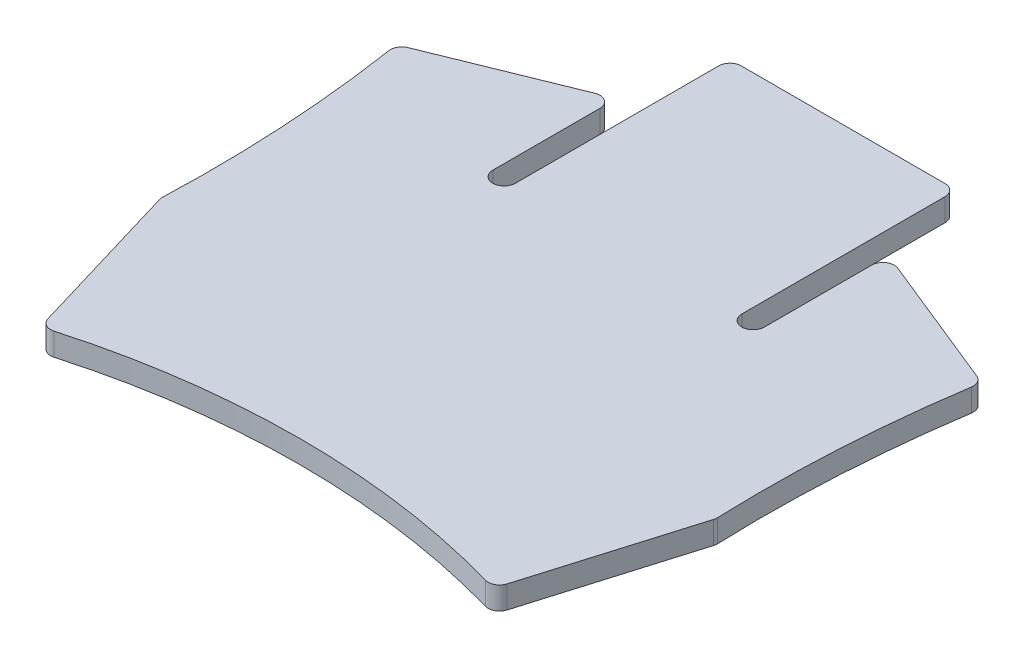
ISO-10303-21;
HEADER;
FILE_DESCRIPTION(('STEP AP214'),'2;1');
FILE_NAME('part.step','',(''),(''),'','','');
FILE_SCHEMA(('AUTOMOTIVE_DESIGN { 1 0 10303 214 1 1 1 1 }'));
ENDSEC;
DATA;
#1=APPLICATION_CONTEXT('core data for automotive mechanical design processes');
#2=APPLICATION_PROTOCOL_DEFINITION('international standard','automotive_design',2000,#1);
#3=PRODUCT_CONTEXT('',#1,'mechanical');
#4=PRODUCT('Part','Part','',(#3));
#5=PRODUCT_RELATED_PRODUCT_CATEGORY('part','',(#4));
#6=PRODUCT_DEFINITION_FORMATION('','',#4);
#7=PRODUCT_DEFINITION_CONTEXT('part definition',#1,'design');
#8=PRODUCT_DEFINITION('design','',#6,#7);
#9=PRODUCT_DEFINITION_SHAPE('','',#8);
#10=(LENGTH_UNIT() NAMED_UNIT(*) SI_UNIT(.MILLI.,.METRE.));
#11=(NAMED_UNIT(*) PLANE_ANGLE_UNIT() SI_UNIT($,.RADIAN.));
#12=(NAMED_UNIT(*) SI_UNIT($,.STERADIAN.) SOLID_ANGLE_UNIT());
#13=UNCERTAINTY_MEASURE_WITH_UNIT(LENGTH_MEASURE(1.E-05),#10,'distance_accuracy_value','');
#14=(GEOMETRIC_REPRESENTATION_CONTEXT(3) GLOBAL_UNCERTAINTY_ASSIGNED_CONTEXT((#13)) GLOBAL_UNIT_ASSIGNED_CONTEXT((#10,
#11,#12)) REPRESENTATION_CONTEXT('',''));
#15=CARTESIAN_POINT('',(0.,0.,0.));
#16=DIRECTION('',(0.,0.,1.));
#17=DIRECTION('',(1.,0.,0.));
#18=AXIS2_PLACEMENT_3D('',#15,#16,#17);
#19=CARTESIAN_POINT('',(-11.,2.,-2.49352029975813));
#20=DIRECTION('',(0.,-1.,0.));
#21=DIRECTION('',(0.,0.,-1.));
#22=AXIS2_PLACEMENT_3D('',#19,#20,#21);
#23=CYLINDRICAL_SURFACE('',#22,0.999999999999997);
#24=CARTESIAN_POINT('',(-11.,0.,-2.49352029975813));
#25=DIRECTION('',(0.,-1.,0.));
#26=DIRECTION('',(0.,0.,-1.));
#27=AXIS2_PLACEMENT_3D('',#24,#25,#26);
#28=CIRCLE('',#27,0.999999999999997);
#29=CARTESIAN_POINT('',(-10.,0.,-2.49352029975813));
#30=VERTEX_POINT('',#29);
#31=CARTESIAN_POINT('',(-12.,0.,-2.49352029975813));
#32=VERTEX_POINT('',#31);
#33=EDGE_CURVE('E224',#30,#32,#28,.T.);
#34=ORIENTED_EDGE('',*,*,#33,.T.);
#35=DIRECTION('',(0.,-1.,0.));
#36=VECTOR('',#35,1.);
#37=CARTESIAN_POINT('',(-12.,2.,-2.49352029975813));
#38=LINE('',#37,#36);
#39=CARTESIAN_POINT('',(-12.,2.,-2.49352029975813));
#40=VERTEX_POINT('',#39);
#41=EDGE_CURVE('E11',#40,#32,#38,.T.);
#42=ORIENTED_EDGE('',*,*,#41,.F.);
#43=CARTESIAN_POINT('',(-11.,2.,-2.49352029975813));
#44=DIRECTION('',(0.,-1.,0.));
#45=DIRECTION('',(0.,0.,-1.));
#46=AXIS2_PLACEMENT_3D('',#43,#44,#45);
#47=CIRCLE('',#46,0.999999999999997);
#48=CARTESIAN_POINT('',(-10.,2.,-2.49352029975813));
#49=VERTEX_POINT('',#48);
#50=EDGE_CURVE('E271',#49,#40,#47,.T.);
#51=ORIENTED_EDGE('',*,*,#50,.F.);
#52=DIRECTION('',(0.,-1.,0.));
#53=VECTOR('',#52,1.);
#54=CARTESIAN_POINT('',(-10.,2.,-2.49352029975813));
#55=LINE('',#54,#53);
#56=EDGE_CURVE('E220',#49,#30,#55,.T.);
#57=ORIENTED_EDGE('',*,*,#56,.T.);
#58=EDGE_LOOP('',(#34,#42,#51,#57));
#59=FACE_BOUND('',#58,.T.);
#60=ADVANCED_FACE('F32',(#59),#23,.F.);
#61=CARTESIAN_POINT('',(-12.,2.,-2.49352029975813));
#62=DIRECTION('',(-1.,0.,0.));
#63=DIRECTION('',(0.,0.,1.));
#64=AXIS2_PLACEMENT_3D('',#61,#62,#63);
#65=PLANE('',#64);
#66=DIRECTION('',(0.,0.,-1.));
#67=VECTOR('',#66,1.);
#68=CARTESIAN_POINT('',(-12.,0.,-2.49352029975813));
#69=LINE('',#68,#67);
#70=CARTESIAN_POINT('',(-12.,0.,-11.9635562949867));
#71=VERTEX_POINT('',#70);
#72=EDGE_CURVE('E227',#32,#71,#69,.T.);
#73=ORIENTED_EDGE('',*,*,#72,.T.);
#74=DIRECTION('',(0.,-1.,0.));
#75=VECTOR('',#74,1.);
#76=CARTESIAN_POINT('',(-12.,2.,-11.9635562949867));
#77=LINE('',#76,#75);
#78=CARTESIAN_POINT('',(-12.,2.,-11.9635562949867));
#79=VERTEX_POINT('',#78);
#80=EDGE_CURVE('E40',#79,#71,#77,.T.);
#81=ORIENTED_EDGE('',*,*,#80,.F.);
#82=DIRECTION('',(0.,0.,-1.));
#83=VECTOR('',#82,1.);
#84=CARTESIAN_POINT('',(-12.,2.,-2.49352029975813));
#85=LINE('',#84,#83);
#86=EDGE_CURVE('E139',#40,#79,#85,.T.);
#87=ORIENTED_EDGE('',*,*,#86,.F.);
#88=ORIENTED_EDGE('',*,*,#41,.T.);
#89=EDGE_LOOP('',(#73,#81,#87,#88));
#90=FACE_BOUND('',#89,.T.);
#91=ADVANCED_FACE('F409',(#90),#65,.F.);
#92=CARTESIAN_POINT('',(-13.,2.,-11.9635562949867));
#93=DIRECTION('',(0.,-1.,0.));
#94=DIRECTION('',(0.,0.,-1.));
#95=AXIS2_PLACEMENT_3D('',#92,#93,#94);
#96=CYLINDRICAL_SURFACE('',#95,1.);
#97=CARTESIAN_POINT('',(-13.,0.,-11.9635562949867));
#98=DIRECTION('',(0.,1.,0.));
#99=DIRECTION('',(0.,0.,1.));
#100=AXIS2_PLACEMENT_3D('',#97,#98,#99);
#101=CIRCLE('',#100,1.);
#102=CARTESIAN_POINT('',(-13.3756805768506,0.,-12.8903055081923));
#103=VERTEX_POINT('',#102);
#104=EDGE_CURVE('E229',#71,#103,#101,.T.);
#105=ORIENTED_EDGE('',*,*,#104,.T.);
#106=DIRECTION('',(0.,-1.,0.));
#107=VECTOR('',#106,1.);
#108=CARTESIAN_POINT('',(-13.3756805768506,2.,-12.8903055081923));
#109=LINE('',#108,#107);
#110=CARTESIAN_POINT('',(-13.3756805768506,2.,-12.8903055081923));
#111=VERTEX_POINT('',#110);
#112=EDGE_CURVE('E326',#111,#103,#109,.T.);
#113=ORIENTED_EDGE('',*,*,#112,.F.);
#114=CARTESIAN_POINT('',(-13.,2.,-11.9635562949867));
#115=DIRECTION('',(0.,1.,0.));
#116=DIRECTION('',(0.,0.,1.));
#117=AXIS2_PLACEMENT_3D('',#114,#115,#116);
#118=CIRCLE('',#117,1.);
#119=EDGE_CURVE('E334',#79,#111,#118,.T.);
#120=ORIENTED_EDGE('',*,*,#119,.F.);
#121=ORIENTED_EDGE('',*,*,#80,.T.);
#122=EDGE_LOOP('',(#105,#113,#120,#121));
#123=FACE_BOUND('',#122,.T.);
#124=ADVANCED_FACE('F332',(#123),#96,.T.);
#125=CARTESIAN_POINT('',(-13.3756805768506,2.,-12.8903055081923));
#126=DIRECTION('',(0.375680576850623,0.,0.926749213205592));
#127=DIRECTION('',(0.926749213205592,0.,-0.375680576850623));
#128=AXIS2_PLACEMENT_3D('',#125,#126,#127);
#129=PLANE('',#128);
#130=DIRECTION('',(-0.926749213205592,0.,0.375680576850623));
#131=VECTOR('',#130,1.);
#132=CARTESIAN_POINT('',(-13.3756805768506,0.,-12.8903055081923));
#133=LINE('',#132,#131);
#134=CARTESIAN_POINT('',(-25.1183486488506,0.,-8.13012632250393));
#135=VERTEX_POINT('',#134);
#136=EDGE_CURVE('E231',#103,#135,#133,.T.);
#137=ORIENTED_EDGE('',*,*,#136,.T.);
#138=DIRECTION('',(0.,-1.,0.));
#139=VECTOR('',#138,1.);
#140=CARTESIAN_POINT('',(-25.1183486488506,2.,-8.13012632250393));
#141=LINE('',#140,#139);
#142=CARTESIAN_POINT('',(-25.1183486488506,2.,-8.13012632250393));
#143=VERTEX_POINT('',#142);
#144=EDGE_CURVE('E323',#143,#135,#141,.T.);
#145=ORIENTED_EDGE('',*,*,#144,.F.);
#146=DIRECTION('',(-0.926749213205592,0.,0.375680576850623));
#147=VECTOR('',#146,1.);
#148=CARTESIAN_POINT('',(-13.3756805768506,2.,-12.8903055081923));
#149=LINE('',#148,#147);
#150=EDGE_CURVE('E352',#111,#143,#149,.T.);
#151=ORIENTED_EDGE('',*,*,#150,.F.);
#152=ORIENTED_EDGE('',*,*,#112,.T.);
#153=EDGE_LOOP('',(#137,#145,#151,#152));
#154=FACE_BOUND('',#153,.T.);
#155=ADVANCED_FACE('F343',(#154),#129,.F.);
#156=CARTESIAN_POINT('',(-24.7426680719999,2.,-7.20337710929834));
#157=DIRECTION('',(0.,-1.,0.));
#158=DIRECTION('',(0.,0.,-1.));
#159=AXIS2_PLACEMENT_3D('',#156,#157,#158);
#160=CYLINDRICAL_SURFACE('',#159,0.999999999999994);
#161=CARTESIAN_POINT('',(-24.7426680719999,0.,-7.20337710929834));
#162=DIRECTION('',(0.,1.,0.));
#163=DIRECTION('',(0.,0.,1.));
#164=AXIS2_PLACEMENT_3D('',#161,#162,#163);
#165=CIRCLE('',#164,0.999999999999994);
#166=CARTESIAN_POINT('',(-25.7312131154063,0.,-7.05245097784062));
#167=VERTEX_POINT('',#166);
#168=EDGE_CURVE('E233',#135,#167,#165,.T.);
#169=ORIENTED_EDGE('',*,*,#168,.T.);
#170=DIRECTION('',(0.,-1.,0.));
#171=VECTOR('',#170,1.);
#172=CARTESIAN_POINT('',(-25.7312131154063,2.,-7.05245097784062));
#173=LINE('',#172,#171);
#174=CARTESIAN_POINT('',(-25.7312131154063,2.,-7.05245097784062));
#175=VERTEX_POINT('',#174);
#176=EDGE_CURVE('E320',#175,#167,#173,.T.);
#177=ORIENTED_EDGE('',*,*,#176,.F.);
#178=CARTESIAN_POINT('',(-24.7426680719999,2.,-7.20337710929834));
#179=DIRECTION('',(0.,1.,0.));
#180=DIRECTION('',(0.,0.,1.));
#181=AXIS2_PLACEMENT_3D('',#178,#179,#180);
#182=CIRCLE('',#181,0.999999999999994);
#183=EDGE_CURVE('E349',#143,#175,#182,.T.);
#184=ORIENTED_EDGE('',*,*,#183,.F.);
#185=ORIENTED_EDGE('',*,*,#144,.T.);
#186=EDGE_LOOP('',(#169,#177,#184,#185));
#187=FACE_BOUND('',#186,.T.);
#188=ADVANCED_FACE('F347',(#187),#160,.T.);
#189=CARTESIAN_POINT('',(-137.420977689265,2.,9.99978574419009));
#190=DIRECTION('',(0.,-1.,0.));
#191=DIRECTION('',(0.,0.,-1.));
#192=AXIS2_PLACEMENT_3D('',#189,#190,#191);
#193=CYLINDRICAL_SURFACE('',#192,112.983991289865);
#194=CARTESIAN_POINT('',(-137.420977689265,0.,9.99978574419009));
#195=DIRECTION('',(0.,-1.,0.));
#196=DIRECTION('',(0.,0.,1.));
#197=AXIS2_PLACEMENT_3D('',#194,#195,#196);
#198=CIRCLE('',#197,112.983991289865);
#199=CARTESIAN_POINT('',(-24.5131470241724,0.,14.1475637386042));
#200=VERTEX_POINT('',#199);
#201=EDGE_CURVE('E235',#167,#200,#198,.T.);
#202=ORIENTED_EDGE('',*,*,#201,.T.);
#203=DIRECTION('',(0.,-1.,0.));
#204=VECTOR('',#203,1.);
#205=CARTESIAN_POINT('',(-24.5131470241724,2.,14.1475637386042));
#206=LINE('',#205,#204);
#207=CARTESIAN_POINT('',(-24.5131470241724,2.,14.1475637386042));
#208=VERTEX_POINT('',#207);
#209=EDGE_CURVE('E317',#208,#200,#206,.T.);
#210=ORIENTED_EDGE('',*,*,#209,.F.);
#211=CARTESIAN_POINT('',(-137.420977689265,2.,9.99978574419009));
#212=DIRECTION('',(0.,-1.,0.));
#213=DIRECTION('',(0.,0.,1.));
#214=AXIS2_PLACEMENT_3D('',#211,#212,#213);
#215=CIRCLE('',#214,112.983991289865);
#216=EDGE_CURVE('E351',#175,#208,#215,.T.);
#217=ORIENTED_EDGE('',*,*,#216,.F.);
#218=ORIENTED_EDGE('',*,*,#176,.T.);
#219=EDGE_LOOP('',(#202,#210,#217,#218));
#220=FACE_BOUND('',#219,.T.);
#221=ADVANCED_FACE('F422',(#220),#193,.F.);
#222=CARTESIAN_POINT('',(-23.5138211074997,2.,14.1842749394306));
#223=DIRECTION('',(0.,-1.,0.));
#224=DIRECTION('',(0.,0.,-1.));
#225=AXIS2_PLACEMENT_3D('',#222,#223,#224);
#226=CYLINDRICAL_SURFACE('',#225,1.);
#227=CARTESIAN_POINT('',(-23.5138211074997,0.,14.1842749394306));
#228=DIRECTION('',(0.,1.,0.));
#229=DIRECTION('',(0.,0.,-1.));
#230=AXIS2_PLACEMENT_3D('',#227,#228,#229);
#231=CIRCLE('',#230,1.);
#232=CARTESIAN_POINT('',(-24.4721359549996,0.,14.4699892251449));
#233=VERTEX_POINT('',#232);
#234=EDGE_CURVE('E237',#200,#233,#231,.T.);
#235=ORIENTED_EDGE('',*,*,#234,.T.);
#236=DIRECTION('',(0.,-1.,0.));
#237=VECTOR('',#236,1.);
#238=CARTESIAN_POINT('',(-24.4721359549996,2.,14.4699892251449));
#239=LINE('',#238,#237);
#240=CARTESIAN_POINT('',(-24.4721359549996,2.,14.4699892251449));
#241=VERTEX_POINT('',#240);
#242=EDGE_CURVE('E314',#241,#233,#239,.T.);
#243=ORIENTED_EDGE('',*,*,#242,.F.);
#244=CARTESIAN_POINT('',(-23.5138211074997,2.,14.1842749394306));
#245=DIRECTION('',(0.,1.,0.));
#246=DIRECTION('',(0.,0.,-1.));
#247=AXIS2_PLACEMENT_3D('',#244,#245,#246);
#248=CIRCLE('',#247,1.);
#249=EDGE_CURVE('E354',#208,#241,#248,.T.);
#250=ORIENTED_EDGE('',*,*,#249,.F.);
#251=ORIENTED_EDGE('',*,*,#209,.T.);
#252=EDGE_LOOP('',(#235,#243,#250,#251));
#253=FACE_BOUND('',#252,.T.);
#254=ADVANCED_FACE('F425',(#253),#226,.T.);
#255=CARTESIAN_POINT('',(-24.4721359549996,2.,14.4699892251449));
#256=DIRECTION('',(0.95831484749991,0.,-0.285714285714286));
#257=DIRECTION('',(-0.285714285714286,0.,-0.95831484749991));
#258=AXIS2_PLACEMENT_3D('',#255,#256,#257);
#259=PLANE('',#258);
#260=DIRECTION('',(0.285714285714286,0.,0.95831484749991));
#261=VECTOR('',#260,1.);
#262=CARTESIAN_POINT('',(-24.4721359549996,0.,14.4699892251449));
#263=LINE('',#262,#261);
#264=CARTESIAN_POINT('',(-20.2837021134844,0.,28.5184234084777));
#265=VERTEX_POINT('',#264);
#266=EDGE_CURVE('E239',#233,#265,#263,.T.);
#267=ORIENTED_EDGE('',*,*,#266,.T.);
#268=DIRECTION('',(0.,-1.,0.));
#269=VECTOR('',#268,1.);
#270=CARTESIAN_POINT('',(-20.2837021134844,2.,28.5184234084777));
#271=LINE('',#270,#269);
#272=CARTESIAN_POINT('',(-20.2837021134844,2.,28.5184234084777));
#273=VERTEX_POINT('',#272);
#274=EDGE_CURVE('E311',#273,#265,#271,.T.);
#275=ORIENTED_EDGE('',*,*,#274,.F.);
#276=DIRECTION('',(0.285714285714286,0.,0.95831484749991));
#277=VECTOR('',#276,1.);
#278=CARTESIAN_POINT('',(-24.4721359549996,2.,14.4699892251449));
#279=LINE('',#278,#277);
#280=EDGE_CURVE('E360',#241,#273,#279,.T.);
#281=ORIENTED_EDGE('',*,*,#280,.F.);
#282=ORIENTED_EDGE('',*,*,#242,.T.);
#283=EDGE_LOOP('',(#267,#275,#281,#282));
#284=FACE_BOUND('',#283,.T.);
#285=ADVANCED_FACE('F429',(#284),#259,.F.);
#286=CARTESIAN_POINT('',(-19.3253872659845,2.,28.2327091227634));
#287=DIRECTION('',(0.,-1.,0.));
#288=DIRECTION('',(0.,0.,-1.));
#289=AXIS2_PLACEMENT_3D('',#286,#287,#288);
#290=CYLINDRICAL_SURFACE('',#289,0.999999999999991);
#291=CARTESIAN_POINT('',(-19.3253872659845,0.,28.2327091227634));
#292=DIRECTION('',(0.,1.,0.));
#293=DIRECTION('',(0.,0.,1.));
#294=AXIS2_PLACEMENT_3D('',#291,#292,#293);
#295=CIRCLE('',#294,0.999999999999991);
#296=CARTESIAN_POINT('',(-19.0531987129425,0.,29.1949530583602));
#297=VERTEX_POINT('',#296);
#298=EDGE_CURVE('E241',#265,#297,#295,.T.);
#299=ORIENTED_EDGE('',*,*,#298,.T.);
#300=DIRECTION('',(0.,-1.,0.));
#301=VECTOR('',#300,1.);
#302=CARTESIAN_POINT('',(-19.0531987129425,2.,29.1949530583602));
#303=LINE('',#302,#301);
#304=CARTESIAN_POINT('',(-19.0531987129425,2.,29.1949530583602));
#305=VERTEX_POINT('',#304);
#306=EDGE_CURVE('E308',#305,#297,#303,.T.);
#307=ORIENTED_EDGE('',*,*,#306,.F.);
#308=CARTESIAN_POINT('',(-19.3253872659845,2.,28.2327091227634));
#309=DIRECTION('',(0.,1.,0.));
#310=DIRECTION('',(0.,0.,1.));
#311=AXIS2_PLACEMENT_3D('',#308,#309,#310);
#312=CIRCLE('',#311,0.999999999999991);
#313=EDGE_CURVE('E362',#273,#305,#312,.T.);
#314=ORIENTED_EDGE('',*,*,#313,.F.);
#315=ORIENTED_EDGE('',*,*,#274,.T.);
#316=EDGE_LOOP('',(#299,#307,#314,#315));
#317=FACE_BOUND('',#316,.T.);
#318=ADVANCED_FACE('F433',(#317),#290,.T.);
#319=CARTESIAN_POINT('',(0.,2.,96.5520285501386));
#320=DIRECTION('',(0.,-1.,0.));
#321=DIRECTION('',(0.,0.,-1.));
#322=AXIS2_PLACEMENT_3D('',#319,#320,#321);
#323=CYLINDRICAL_SURFACE('',#322,70.);
#324=CARTESIAN_POINT('',(0.,0.,96.5520285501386));
#325=DIRECTION('',(0.,-1.,0.));
#326=DIRECTION('',(0.,0.,1.));
#327=AXIS2_PLACEMENT_3D('',#324,#325,#326);
#328=CIRCLE('',#327,70.);
#329=CARTESIAN_POINT('',(19.0531987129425,0.,29.1949530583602));
#330=VERTEX_POINT('',#329);
#331=EDGE_CURVE('E244',#297,#330,#328,.T.);
#332=ORIENTED_EDGE('',*,*,#331,.T.);
#333=DIRECTION('',(0.,-1.,0.));
#334=VECTOR('',#333,1.);
#335=CARTESIAN_POINT('',(19.0531987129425,2.,29.1949530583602));
#336=LINE('',#335,#334);
#337=CARTESIAN_POINT('',(19.0531987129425,2.,29.1949530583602));
#338=VERTEX_POINT('',#337);
#339=EDGE_CURVE('E305',#338,#330,#336,.T.);
#340=ORIENTED_EDGE('',*,*,#339,.F.);
#341=CARTESIAN_POINT('',(0.,2.,96.5520285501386));
#342=DIRECTION('',(0.,-1.,0.));
#343=DIRECTION('',(0.,0.,-1.));
#344=AXIS2_PLACEMENT_3D('',#341,#342,#343);
#345=CIRCLE('',#344,70.);
#346=EDGE_CURVE('E364',#305,#338,#345,.T.);
#347=ORIENTED_EDGE('',*,*,#346,.F.);
#348=ORIENTED_EDGE('',*,*,#306,.T.);
#349=EDGE_LOOP('',(#332,#340,#347,#348));
#350=FACE_BOUND('',#349,.T.);
#351=ADVANCED_FACE('F437',(#350),#323,.F.);
#352=CARTESIAN_POINT('',(19.3253872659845,2.,28.2327091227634));
#353=DIRECTION('',(0.,-1.,0.));
#354=DIRECTION('',(0.,0.,-1.));
#355=AXIS2_PLACEMENT_3D('',#352,#353,#354);
#356=CYLINDRICAL_SURFACE('',#355,0.999999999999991);
#357=CARTESIAN_POINT('',(19.3253872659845,0.,28.2327091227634));
#358=DIRECTION('',(0.,1.,0.));
#359=DIRECTION('',(0.,0.,-1.));
#360=AXIS2_PLACEMENT_3D('',#357,#358,#359);
#361=CIRCLE('',#360,0.999999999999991);
#362=CARTESIAN_POINT('',(20.2837021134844,0.,28.5184234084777));
#363=VERTEX_POINT('',#362);
#364=EDGE_CURVE('E246',#330,#363,#361,.T.);
#365=ORIENTED_EDGE('',*,*,#364,.T.);
#366=DIRECTION('',(0.,-1.,0.));
#367=VECTOR('',#366,1.);
#368=CARTESIAN_POINT('',(20.2837021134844,2.,28.5184234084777));
#369=LINE('',#368,#367);
#370=CARTESIAN_POINT('',(20.2837021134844,2.,28.5184234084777));
#371=VERTEX_POINT('',#370);
#372=EDGE_CURVE('E302',#371,#363,#369,.T.);
#373=ORIENTED_EDGE('',*,*,#372,.F.);
#374=CARTESIAN_POINT('',(19.3253872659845,2.,28.2327091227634));
#375=DIRECTION('',(0.,1.,0.));
#376=DIRECTION('',(0.,0.,-1.));
#377=AXIS2_PLACEMENT_3D('',#374,#375,#376);
#378=CIRCLE('',#377,0.999999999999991);
#379=EDGE_CURVE('E366',#338,#371,#378,.T.);
#380=ORIENTED_EDGE('',*,*,#379,.F.);
#381=ORIENTED_EDGE('',*,*,#339,.T.);
#382=EDGE_LOOP('',(#365,#373,#380,#381));
#383=FACE_BOUND('',#382,.T.);
#384=ADVANCED_FACE('F441',(#383),#356,.T.);
#385=CARTESIAN_POINT('',(24.4721359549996,2.,14.4699892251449));
#386=DIRECTION('',(-0.95831484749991,0.,-0.285714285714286));
#387=DIRECTION('',(-0.285714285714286,0.,0.95831484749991));
#388=AXIS2_PLACEMENT_3D('',#385,#386,#387);
#389=PLANE('',#388);
#390=DIRECTION('',(0.285714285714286,0.,-0.95831484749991));
#391=VECTOR('',#390,1.);
#392=CARTESIAN_POINT('',(24.4721359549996,0.,14.4699892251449));
#393=LINE('',#392,#391);
#394=CARTESIAN_POINT('',(24.4721359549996,0.,14.4699892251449));
#395=VERTEX_POINT('',#394);
#396=EDGE_CURVE('E248',#363,#395,#393,.T.);
#397=ORIENTED_EDGE('',*,*,#396,.T.);
#398=DIRECTION('',(0.,-1.,0.));
#399=VECTOR('',#398,1.);
#400=CARTESIAN_POINT('',(24.4721359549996,2.,14.4699892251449));
#401=LINE('',#400,#399);
#402=CARTESIAN_POINT('',(24.4721359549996,2.,14.4699892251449));
#403=VERTEX_POINT('',#402);
#404=EDGE_CURVE('E299',#403,#395,#401,.T.);
#405=ORIENTED_EDGE('',*,*,#404,.F.);
#406=DIRECTION('',(0.285714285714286,0.,-0.95831484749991));
#407=VECTOR('',#406,1.);
#408=CARTESIAN_POINT('',(24.4721359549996,2.,14.4699892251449));
#409=LINE('',#408,#407);
#410=EDGE_CURVE('E368',#371,#403,#409,.T.);
#411=ORIENTED_EDGE('',*,*,#410,.F.);
#412=ORIENTED_EDGE('',*,*,#372,.T.);
#413=EDGE_LOOP('',(#397,#405,#411,#412));
#414=FACE_BOUND('',#413,.T.);
#415=ADVANCED_FACE('F445',(#414),#389,.F.);
#416=CARTESIAN_POINT('',(23.5138211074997,2.,14.1842749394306));
#417=DIRECTION('',(0.,-1.,0.));
#418=DIRECTION('',(0.,0.,-1.));
#419=AXIS2_PLACEMENT_3D('',#416,#417,#418);
#420=CYLINDRICAL_SURFACE('',#419,1.);
#421=CARTESIAN_POINT('',(23.5138211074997,0.,14.1842749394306));
#422=DIRECTION('',(0.,1.,0.));
#423=DIRECTION('',(0.,0.,1.));
#424=AXIS2_PLACEMENT_3D('',#421,#422,#423);
#425=CIRCLE('',#424,1.);
#426=CARTESIAN_POINT('',(24.5131470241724,0.,14.1475637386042));
#427=VERTEX_POINT('',#426);
#428=EDGE_CURVE('E250',#395,#427,#425,.T.);
#429=ORIENTED_EDGE('',*,*,#428,.T.);
#430=DIRECTION('',(0.,-1.,0.));
#431=VECTOR('',#430,1.);
#432=CARTESIAN_POINT('',(24.5131470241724,2.,14.1475637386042));
#433=LINE('',#432,#431);
#434=CARTESIAN_POINT('',(24.5131470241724,2.,14.1475637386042));
#435=VERTEX_POINT('',#434);
#436=EDGE_CURVE('E296',#435,#427,#433,.T.);
#437=ORIENTED_EDGE('',*,*,#436,.F.);
#438=CARTESIAN_POINT('',(23.5138211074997,2.,14.1842749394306));
#439=DIRECTION('',(0.,1.,0.));
#440=DIRECTION('',(0.,0.,1.));
#441=AXIS2_PLACEMENT_3D('',#438,#439,#440);
#442=CIRCLE('',#441,1.);
#443=EDGE_CURVE('E370',#403,#435,#442,.T.);
#444=ORIENTED_EDGE('',*,*,#443,.F.);
#445=ORIENTED_EDGE('',*,*,#404,.T.);
#446=EDGE_LOOP('',(#429,#437,#444,#445));
#447=FACE_BOUND('',#446,.T.);
#448=ADVANCED_FACE('F449',(#447),#420,.T.);
#449=CARTESIAN_POINT('',(137.420977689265,2.,9.99978574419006));
#450=DIRECTION('',(0.,-1.,0.));
#451=DIRECTION('',(0.,0.,-1.));
#452=AXIS2_PLACEMENT_3D('',#449,#450,#451);
#453=CYLINDRICAL_SURFACE('',#452,112.983991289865);
#454=CARTESIAN_POINT('',(137.420977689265,0.,9.99978574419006));
#455=DIRECTION('',(0.,-1.,0.));
#456=DIRECTION('',(0.,0.,-1.));
#457=AXIS2_PLACEMENT_3D('',#454,#455,#456);
#458=CIRCLE('',#457,112.983991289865);
#459=CARTESIAN_POINT('',(25.7312131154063,0.,-7.05245097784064));
#460=VERTEX_POINT('',#459);
#461=EDGE_CURVE('E252',#427,#460,#458,.T.);
#462=ORIENTED_EDGE('',*,*,#461,.T.);
#463=DIRECTION('',(0.,-1.,0.));
#464=VECTOR('',#463,1.);
#465=CARTESIAN_POINT('',(25.7312131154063,2.,-7.05245097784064));
#466=LINE('',#465,#464);
#467=CARTESIAN_POINT('',(25.7312131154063,2.,-7.05245097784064));
#468=VERTEX_POINT('',#467);
#469=EDGE_CURVE('E293',#468,#460,#466,.T.);
#470=ORIENTED_EDGE('',*,*,#469,.F.);
#471=CARTESIAN_POINT('',(137.420977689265,2.,9.99978574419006));
#472=DIRECTION('',(0.,-1.,0.));
#473=DIRECTION('',(0.,0.,-1.));
#474=AXIS2_PLACEMENT_3D('',#471,#472,#473);
#475=CIRCLE('',#474,112.983991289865);
#476=EDGE_CURVE('E372',#435,#468,#475,.T.);
#477=ORIENTED_EDGE('',*,*,#476,.F.);
#478=ORIENTED_EDGE('',*,*,#436,.T.);
#479=EDGE_LOOP('',(#462,#470,#477,#478));
#480=FACE_BOUND('',#479,.T.);
#481=ADVANCED_FACE('F453',(#480),#453,.F.);
#482=CARTESIAN_POINT('',(24.7426680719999,2.,-7.20337710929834));
#483=DIRECTION('',(0.,-1.,0.));
#484=DIRECTION('',(0.,0.,-1.));
#485=AXIS2_PLACEMENT_3D('',#482,#483,#484);
#486=CYLINDRICAL_SURFACE('',#485,0.999999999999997);
#487=CARTESIAN_POINT('',(24.7426680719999,0.,-7.20337710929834));
#488=DIRECTION('',(0.,1.,0.));
#489=DIRECTION('',(0.,0.,-1.));
#490=AXIS2_PLACEMENT_3D('',#487,#488,#489);
#491=CIRCLE('',#490,0.999999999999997);
#492=CARTESIAN_POINT('',(25.1183486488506,0.,-8.13012632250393));
#493=VERTEX_POINT('',#492);
#494=EDGE_CURVE('E254',#460,#493,#491,.T.);
#495=ORIENTED_EDGE('',*,*,#494,.T.);
#496=DIRECTION('',(0.,-1.,0.));
#497=VECTOR('',#496,1.);
#498=CARTESIAN_POINT('',(25.1183486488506,2.,-8.13012632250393));
#499=LINE('',#498,#497);
#500=CARTESIAN_POINT('',(25.1183486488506,2.,-8.13012632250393));
#501=VERTEX_POINT('',#500);
#502=EDGE_CURVE('E290',#501,#493,#499,.T.);
#503=ORIENTED_EDGE('',*,*,#502,.F.);
#504=CARTESIAN_POINT('',(24.7426680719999,2.,-7.20337710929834));
#505=DIRECTION('',(0.,1.,0.));
#506=DIRECTION('',(0.,0.,-1.));
#507=AXIS2_PLACEMENT_3D('',#504,#505,#506);
#508=CIRCLE('',#507,0.999999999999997);
#509=EDGE_CURVE('E374',#468,#501,#508,.T.);
#510=ORIENTED_EDGE('',*,*,#509,.F.);
#511=ORIENTED_EDGE('',*,*,#469,.T.);
#512=EDGE_LOOP('',(#495,#503,#510,#511));
#513=FACE_BOUND('',#512,.T.);
#514=ADVANCED_FACE('F457',(#513),#486,.T.);
#515=CARTESIAN_POINT('',(13.3756805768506,2.,-12.8903055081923));
#516=DIRECTION('',(-0.375680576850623,0.,0.926749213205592));
#517=DIRECTION('',(0.926749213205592,0.,0.375680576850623));
#518=AXIS2_PLACEMENT_3D('',#515,#516,#517);
#519=PLANE('',#518);
#520=DIRECTION('',(-0.926749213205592,0.,-0.375680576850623));
#521=VECTOR('',#520,1.);
#522=CARTESIAN_POINT('',(13.3756805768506,0.,-12.8903055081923));
#523=LINE('',#522,#521);
#524=CARTESIAN_POINT('',(13.3756805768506,0.,-12.8903055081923));
#525=VERTEX_POINT('',#524);
#526=EDGE_CURVE('E256',#493,#525,#523,.T.);
#527=ORIENTED_EDGE('',*,*,#526,.T.);
#528=DIRECTION('',(0.,-1.,0.));
#529=VECTOR('',#528,1.);
#530=CARTESIAN_POINT('',(13.3756805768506,2.,-12.8903055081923));
#531=LINE('',#530,#529);
#532=CARTESIAN_POINT('',(13.3756805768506,2.,-12.8903055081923));
#533=VERTEX_POINT('',#532);
#534=EDGE_CURVE('E287',#533,#525,#531,.T.);
#535=ORIENTED_EDGE('',*,*,#534,.F.);
#536=DIRECTION('',(-0.926749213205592,0.,-0.375680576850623));
#537=VECTOR('',#536,1.);
#538=CARTESIAN_POINT('',(13.3756805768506,2.,-12.8903055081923));
#539=LINE('',#538,#537);
#540=EDGE_CURVE('E376',#501,#533,#539,.T.);
#541=ORIENTED_EDGE('',*,*,#540,.F.);
#542=ORIENTED_EDGE('',*,*,#502,.T.);
#543=EDGE_LOOP('',(#527,#535,#541,#542));
#544=FACE_BOUND('',#543,.T.);
#545=ADVANCED_FACE('F461',(#544),#519,.F.);
#546=CARTESIAN_POINT('',(13.,2.,-11.9635562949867));
#547=DIRECTION('',(0.,-1.,0.));
#548=DIRECTION('',(0.,0.,-1.));
#549=AXIS2_PLACEMENT_3D('',#546,#547,#548);
#550=CYLINDRICAL_SURFACE('',#549,1.);
#551=CARTESIAN_POINT('',(13.,0.,-11.9635562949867));
#552=DIRECTION('',(0.,1.,0.));
#553=DIRECTION('',(0.,0.,-1.));
#554=AXIS2_PLACEMENT_3D('',#551,#552,#553);
#555=CIRCLE('',#554,1.);
#556=CARTESIAN_POINT('',(12.,0.,-11.9635562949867));
#557=VERTEX_POINT('',#556);
#558=EDGE_CURVE('E258',#525,#557,#555,.T.);
#559=ORIENTED_EDGE('',*,*,#558,.T.);
#560=DIRECTION('',(0.,-1.,0.));
#561=VECTOR('',#560,1.);
#562=CARTESIAN_POINT('',(12.,2.,-11.9635562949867));
#563=LINE('',#562,#561);
#564=CARTESIAN_POINT('',(12.,2.,-11.9635562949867));
#565=VERTEX_POINT('',#564);
#566=EDGE_CURVE('E284',#565,#557,#563,.T.);
#567=ORIENTED_EDGE('',*,*,#566,.F.);
#568=CARTESIAN_POINT('',(13.,2.,-11.9635562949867));
#569=DIRECTION('',(0.,1.,0.));
#570=DIRECTION('',(0.,0.,-1.));
#571=AXIS2_PLACEMENT_3D('',#568,#569,#570);
#572=CIRCLE('',#571,1.);
#573=EDGE_CURVE('E378',#533,#565,#572,.T.);
#574=ORIENTED_EDGE('',*,*,#573,.F.);
#575=ORIENTED_EDGE('',*,*,#534,.T.);
#576=EDGE_LOOP('',(#559,#567,#574,#575));
#577=FACE_BOUND('',#576,.T.);
#578=ADVANCED_FACE('F465',(#577),#550,.T.);
#579=CARTESIAN_POINT('',(12.,2.,-2.49352029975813));
#580=DIRECTION('',(1.,0.,0.));
#581=DIRECTION('',(0.,0.,-1.));
#582=AXIS2_PLACEMENT_3D('',#579,#580,#581);
#583=PLANE('',#582);
#584=DIRECTION('',(0.,0.,1.));
#585=VECTOR('',#584,1.);
#586=CARTESIAN_POINT('',(12.,0.,-2.49352029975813));
#587=LINE('',#586,#585);
#588=CARTESIAN_POINT('',(12.,0.,-2.49352029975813));
#589=VERTEX_POINT('',#588);
#590=EDGE_CURVE('E260',#557,#589,#587,.T.);
#591=ORIENTED_EDGE('',*,*,#590,.T.);
#592=DIRECTION('',(0.,-1.,0.));
#593=VECTOR('',#592,1.);
#594=CARTESIAN_POINT('',(12.,2.,-2.49352029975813));
#595=LINE('',#594,#593);
#596=CARTESIAN_POINT('',(12.,2.,-2.49352029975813));
#597=VERTEX_POINT('',#596);
#598=EDGE_CURVE('E281',#597,#589,#595,.T.);
#599=ORIENTED_EDGE('',*,*,#598,.F.);
#600=DIRECTION('',(0.,0.,1.));
#601=VECTOR('',#600,1.);
#602=CARTESIAN_POINT('',(12.,2.,-2.49352029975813));
#603=LINE('',#602,#601);
#604=EDGE_CURVE('E380',#565,#597,#603,.T.);
#605=ORIENTED_EDGE('',*,*,#604,.F.);
#606=ORIENTED_EDGE('',*,*,#566,.T.);
#607=EDGE_LOOP('',(#591,#599,#605,#606));
#608=FACE_BOUND('',#607,.T.);
#609=ADVANCED_FACE('F469',(#608),#583,.F.);
#610=CARTESIAN_POINT('',(11.,2.,-2.49352029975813));
#611=DIRECTION('',(0.,-1.,0.));
#612=DIRECTION('',(0.,0.,-1.));
#613=AXIS2_PLACEMENT_3D('',#610,#611,#612);
#614=CYLINDRICAL_SURFACE('',#613,0.999999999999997);
#615=CARTESIAN_POINT('',(11.,0.,-2.49352029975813));
#616=DIRECTION('',(0.,-1.,0.));
#617=DIRECTION('',(0.,0.,1.));
#618=AXIS2_PLACEMENT_3D('',#615,#616,#617);
#619=CIRCLE('',#618,0.999999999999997);
#620=CARTESIAN_POINT('',(10.,0.,-2.49352029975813));
#621=VERTEX_POINT('',#620);
#622=EDGE_CURVE('E262',#589,#621,#619,.T.);
#623=ORIENTED_EDGE('',*,*,#622,.T.);
#624=DIRECTION('',(0.,-1.,0.));
#625=VECTOR('',#624,1.);
#626=CARTESIAN_POINT('',(10.,2.,-2.49352029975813));
#627=LINE('',#626,#625);
#628=CARTESIAN_POINT('',(10.,2.,-2.49352029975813));
#629=VERTEX_POINT('',#628);
#630=EDGE_CURVE('E278',#629,#621,#627,.T.);
#631=ORIENTED_EDGE('',*,*,#630,.F.);
#632=CARTESIAN_POINT('',(11.,2.,-2.49352029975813));
#633=DIRECTION('',(0.,-1.,0.));
#634=DIRECTION('',(0.,0.,1.));
#635=AXIS2_PLACEMENT_3D('',#632,#633,#634);
#636=CIRCLE('',#635,0.999999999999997);
#637=EDGE_CURVE('E382',#597,#629,#636,.T.);
#638=ORIENTED_EDGE('',*,*,#637,.F.);
#639=ORIENTED_EDGE('',*,*,#598,.T.);
#640=EDGE_LOOP('',(#623,#631,#638,#639));
#641=FACE_BOUND('',#640,.T.);
#642=ADVANCED_FACE('F473',(#641),#614,.F.);
#643=CARTESIAN_POINT('',(10.,2.,-20.4479714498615));
#644=DIRECTION('',(-1.,0.,0.));
#645=DIRECTION('',(0.,0.,1.));
#646=AXIS2_PLACEMENT_3D('',#643,#644,#645);
#647=PLANE('',#646);
#648=DIRECTION('',(0.,0.,-1.));
#649=VECTOR('',#648,1.);
#650=CARTESIAN_POINT('',(10.,0.,-20.4479714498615));
#651=LINE('',#650,#649);
#652=CARTESIAN_POINT('',(10.,0.,-20.4479714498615));
#653=VERTEX_POINT('',#652);
#654=EDGE_CURVE('E264',#621,#653,#651,.T.);
#655=ORIENTED_EDGE('',*,*,#654,.T.);
#656=DIRECTION('',(0.,-1.,0.));
#657=VECTOR('',#656,1.);
#658=CARTESIAN_POINT('',(10.,2.,-20.4479714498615));
#659=LINE('',#658,#657);
#660=CARTESIAN_POINT('',(10.,2.,-20.4479714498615));
#661=VERTEX_POINT('',#660);
#662=EDGE_CURVE('E275',#661,#653,#659,.T.);
#663=ORIENTED_EDGE('',*,*,#662,.F.);
#664=DIRECTION('',(0.,0.,-1.));
#665=VECTOR('',#664,1.);
#666=CARTESIAN_POINT('',(10.,2.,-20.4479714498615));
#667=LINE('',#666,#665);
#668=EDGE_CURVE('E384',#629,#661,#667,.T.);
#669=ORIENTED_EDGE('',*,*,#668,.F.);
#670=ORIENTED_EDGE('',*,*,#630,.T.);
#671=EDGE_LOOP('',(#655,#663,#669,#670));
#672=FACE_BOUND('',#671,.T.);
#673=ADVANCED_FACE('F390',(#672),#647,.F.);
#674=CARTESIAN_POINT('',(9.,2.,-20.4479714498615));
#675=DIRECTION('',(0.,-1.,0.));
#676=DIRECTION('',(0.,0.,-1.));
#677=AXIS2_PLACEMENT_3D('',#674,#675,#676);
#678=CYLINDRICAL_SURFACE('',#677,1.);
#679=CARTESIAN_POINT('',(9.,0.,-20.4479714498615));
#680=DIRECTION('',(0.,1.,0.));
#681=DIRECTION('',(0.,0.,-1.));
#682=AXIS2_PLACEMENT_3D('',#679,#680,#681);
#683=CIRCLE('',#682,1.);
#684=CARTESIAN_POINT('',(8.99999999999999,0.,-21.4479714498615));
#685=VERTEX_POINT('',#684);
#686=EDGE_CURVE('E266',#653,#685,#683,.T.);
#687=ORIENTED_EDGE('',*,*,#686,.T.);
#688=DIRECTION('',(0.,-1.,0.));
#689=VECTOR('',#688,1.);
#690=CARTESIAN_POINT('',(8.99999999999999,2.,-21.4479714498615));
#691=LINE('',#690,#689);
#692=CARTESIAN_POINT('',(8.99999999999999,2.,-21.4479714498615));
#693=VERTEX_POINT('',#692);
#694=EDGE_CURVE('E215',#693,#685,#691,.T.);
#695=ORIENTED_EDGE('',*,*,#694,.F.);
#696=CARTESIAN_POINT('',(9.,2.,-20.4479714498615));
#697=DIRECTION('',(0.,1.,0.));
#698=DIRECTION('',(0.,0.,-1.));
#699=AXIS2_PLACEMENT_3D('',#696,#697,#698);
#700=CIRCLE('',#699,1.);
#701=EDGE_CURVE('E206',#661,#693,#700,.T.);
#702=ORIENTED_EDGE('',*,*,#701,.F.);
#703=ORIENTED_EDGE('',*,*,#662,.T.);
#704=EDGE_LOOP('',(#687,#695,#702,#703));
#705=FACE_BOUND('',#704,.T.);
#706=ADVANCED_FACE('F394',(#705),#678,.T.);
#707=CARTESIAN_POINT('',(8.99999999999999,2.,-21.4479714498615));
#708=DIRECTION('',(0.,0.,1.));
#709=DIRECTION('',(1.,0.,0.));
#710=AXIS2_PLACEMENT_3D('',#707,#708,#709);
#711=PLANE('',#710);
#712=DIRECTION('',(-1.,0.,0.));
#713=VECTOR('',#712,1.);
#714=CARTESIAN_POINT('',(8.99999999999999,0.,-21.4479714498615));
#715=LINE('',#714,#713);
#716=CARTESIAN_POINT('',(-8.99999999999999,0.,-21.4479714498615));
#717=VERTEX_POINT('',#716);
#718=EDGE_CURVE('E214',#685,#717,#715,.T.);
#719=ORIENTED_EDGE('',*,*,#718,.T.);
#720=DIRECTION('',(0.,-1.,0.));
#721=VECTOR('',#720,1.);
#722=CARTESIAN_POINT('',(-8.99999999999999,2.,-21.4479714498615));
#723=LINE('',#722,#721);
#724=CARTESIAN_POINT('',(-8.99999999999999,2.,-21.4479714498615));
#725=VERTEX_POINT('',#724);
#726=EDGE_CURVE('E211',#725,#717,#723,.T.);
#727=ORIENTED_EDGE('',*,*,#726,.F.);
#728=DIRECTION('',(-1.,0.,0.));
#729=VECTOR('',#728,1.);
#730=CARTESIAN_POINT('',(8.99999999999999,2.,-21.4479714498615));
#731=LINE('',#730,#729);
#732=EDGE_CURVE('E200',#693,#725,#731,.T.);
#733=ORIENTED_EDGE('',*,*,#732,.F.);
#734=ORIENTED_EDGE('',*,*,#694,.T.);
#735=EDGE_LOOP('',(#719,#727,#733,#734));
#736=FACE_BOUND('',#735,.T.);
#737=ADVANCED_FACE('F212',(#736),#711,.F.);
#738=CARTESIAN_POINT('',(-9.,2.,-20.4479714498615));
#739=DIRECTION('',(0.,-1.,0.));
#740=DIRECTION('',(0.,0.,-1.));
#741=AXIS2_PLACEMENT_3D('',#738,#739,#740);
#742=CYLINDRICAL_SURFACE('',#741,1.);
#743=CARTESIAN_POINT('',(-9.,0.,-20.4479714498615));
#744=DIRECTION('',(0.,1.,0.));
#745=DIRECTION('',(0.,0.,1.));
#746=AXIS2_PLACEMENT_3D('',#743,#744,#745);
#747=CIRCLE('',#746,1.);
#748=CARTESIAN_POINT('',(-10.,0.,-20.4479714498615));
#749=VERTEX_POINT('',#748);
#750=EDGE_CURVE('E125',#717,#749,#747,.T.);
#751=ORIENTED_EDGE('',*,*,#750,.T.);
#752=DIRECTION('',(0.,-1.,0.));
#753=VECTOR('',#752,1.);
#754=CARTESIAN_POINT('',(-10.,2.,-20.4479714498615));
#755=LINE('',#754,#753);
#756=CARTESIAN_POINT('',(-10.,2.,-20.4479714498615));
#757=VERTEX_POINT('',#756);
#758=EDGE_CURVE('E216',#757,#749,#755,.T.);
#759=ORIENTED_EDGE('',*,*,#758,.F.);
#760=CARTESIAN_POINT('',(-9.,2.,-20.4479714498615));
#761=DIRECTION('',(0.,1.,0.));
#762=DIRECTION('',(0.,0.,1.));
#763=AXIS2_PLACEMENT_3D('',#760,#761,#762);
#764=CIRCLE('',#763,1.);
#765=EDGE_CURVE('E204',#725,#757,#764,.T.);
#766=ORIENTED_EDGE('',*,*,#765,.F.);
#767=ORIENTED_EDGE('',*,*,#726,.T.);
#768=EDGE_LOOP('',(#751,#759,#766,#767));
#769=FACE_BOUND('',#768,.T.);
#770=ADVANCED_FACE('F218',(#769),#742,.T.);
#771=CARTESIAN_POINT('',(-10.,2.,-20.4479714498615));
#772=DIRECTION('',(1.,0.,0.));
#773=DIRECTION('',(0.,0.,-1.));
#774=AXIS2_PLACEMENT_3D('',#771,#772,#773);
#775=PLANE('',#774);
#776=DIRECTION('',(0.,0.,1.));
#777=VECTOR('',#776,1.);
#778=CARTESIAN_POINT('',(-10.,0.,-20.4479714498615));
#779=LINE('',#778,#777);
#780=EDGE_CURVE('E131',#749,#30,#779,.T.);
#781=ORIENTED_EDGE('',*,*,#780,.T.);
#782=ORIENTED_EDGE('',*,*,#56,.F.);
#783=DIRECTION('',(0.,0.,1.));
#784=VECTOR('',#783,1.);
#785=CARTESIAN_POINT('',(-10.,2.,-20.4479714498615));
#786=LINE('',#785,#784);
#787=EDGE_CURVE('E48',#757,#49,#786,.T.);
#788=ORIENTED_EDGE('',*,*,#787,.F.);
#789=ORIENTED_EDGE('',*,*,#758,.T.);
#790=EDGE_LOOP('',(#781,#782,#788,#789));
#791=FACE_BOUND('',#790,.T.);
#792=ADVANCED_FACE('F398',(#791),#775,.F.);
#793=CARTESIAN_POINT('',(-11.,2.,-2.49352029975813));
#794=DIRECTION('',(0.,-1.,0.));
#795=DIRECTION('',(0.,0.,-1.));
#796=AXIS2_PLACEMENT_3D('',#793,#794,#795);
#797=PLANE('',#796);
#798=ORIENTED_EDGE('',*,*,#50,.T.);
#799=ORIENTED_EDGE('',*,*,#86,.T.);
#800=ORIENTED_EDGE('',*,*,#119,.T.);
#801=ORIENTED_EDGE('',*,*,#150,.T.);
#802=ORIENTED_EDGE('',*,*,#183,.T.);
#803=ORIENTED_EDGE('',*,*,#216,.T.);
#804=ORIENTED_EDGE('',*,*,#249,.T.);
#805=ORIENTED_EDGE('',*,*,#280,.T.);
#806=ORIENTED_EDGE('',*,*,#313,.T.);
#807=ORIENTED_EDGE('',*,*,#346,.T.);
#808=ORIENTED_EDGE('',*,*,#379,.T.);
#809=ORIENTED_EDGE('',*,*,#410,.T.);
#810=ORIENTED_EDGE('',*,*,#443,.T.);
#811=ORIENTED_EDGE('',*,*,#476,.T.);
#812=ORIENTED_EDGE('',*,*,#509,.T.);
#813=ORIENTED_EDGE('',*,*,#540,.T.);
#814=ORIENTED_EDGE('',*,*,#573,.T.);
#815=ORIENTED_EDGE('',*,*,#604,.T.);
#816=ORIENTED_EDGE('',*,*,#637,.T.);
#817=ORIENTED_EDGE('',*,*,#668,.T.);
#818=ORIENTED_EDGE('',*,*,#701,.T.);
#819=ORIENTED_EDGE('',*,*,#732,.T.);
#820=ORIENTED_EDGE('',*,*,#765,.T.);
#821=ORIENTED_EDGE('',*,*,#787,.T.);
#822=EDGE_LOOP('',(#798,#799,#800,#801,#802,#803,#804,#805,#806,#807,#808,#809,#810,#811,#812,
#813,#814,#815,#816,#817,#818,#819,#820,#821));
#823=FACE_BOUND('',#822,.T.);
#824=ADVANCED_FACE('F202',(#823),#797,.F.);
#825=CARTESIAN_POINT('',(-11.,0.,-2.49352029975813));
#826=DIRECTION('',(0.,-1.,0.));
#827=DIRECTION('',(0.,0.,-1.));
#828=AXIS2_PLACEMENT_3D('',#825,#826,#827);
#829=PLANE('',#828);
#830=ORIENTED_EDGE('',*,*,#33,.F.);
#831=ORIENTED_EDGE('',*,*,#780,.F.);
#832=ORIENTED_EDGE('',*,*,#750,.F.);
#833=ORIENTED_EDGE('',*,*,#718,.F.);
#834=ORIENTED_EDGE('',*,*,#686,.F.);
#835=ORIENTED_EDGE('',*,*,#654,.F.);
#836=ORIENTED_EDGE('',*,*,#622,.F.);
#837=ORIENTED_EDGE('',*,*,#590,.F.);
#838=ORIENTED_EDGE('',*,*,#558,.F.);
#839=ORIENTED_EDGE('',*,*,#526,.F.);
#840=ORIENTED_EDGE('',*,*,#494,.F.);
#841=ORIENTED_EDGE('',*,*,#461,.F.);
#842=ORIENTED_EDGE('',*,*,#428,.F.);
#843=ORIENTED_EDGE('',*,*,#396,.F.);
#844=ORIENTED_EDGE('',*,*,#364,.F.);
#845=ORIENTED_EDGE('',*,*,#331,.F.);
#846=ORIENTED_EDGE('',*,*,#298,.F.);
#847=ORIENTED_EDGE('',*,*,#266,.F.);
#848=ORIENTED_EDGE('',*,*,#234,.F.);
#849=ORIENTED_EDGE('',*,*,#201,.F.);
#850=ORIENTED_EDGE('',*,*,#168,.F.);
#851=ORIENTED_EDGE('',*,*,#136,.F.);
#852=ORIENTED_EDGE('',*,*,#104,.F.);
#853=ORIENTED_EDGE('',*,*,#72,.F.);
#854=EDGE_LOOP('',(#830,#831,#832,#833,#834,#835,#836,#837,#838,#839,#840,#841,#842,#843,#844,
#845,#846,#847,#848,#849,#850,#851,#852,#853));
#855=FACE_BOUND('',#854,.T.);
#856=ADVANCED_FACE('F338',(#855),#829,.T.);
#857=CLOSED_SHELL('',(#60,#91,#124,#155,#188,#221,#254,#285,#318,#351,#384,#415,#448,#481,#514,
#545,#578,#609,#642,#673,#706,#737,#770,#792,#824,#856));
#858=MANIFOLD_SOLID_BREP('B2',#857);
#859=ADVANCED_BREP_SHAPE_REPRESENTATION('',(#18,#858),#14);
#860=SHAPE_DEFINITION_REPRESENTATION(#9,#859);
ENDSEC;
END-ISO-10303-21;
